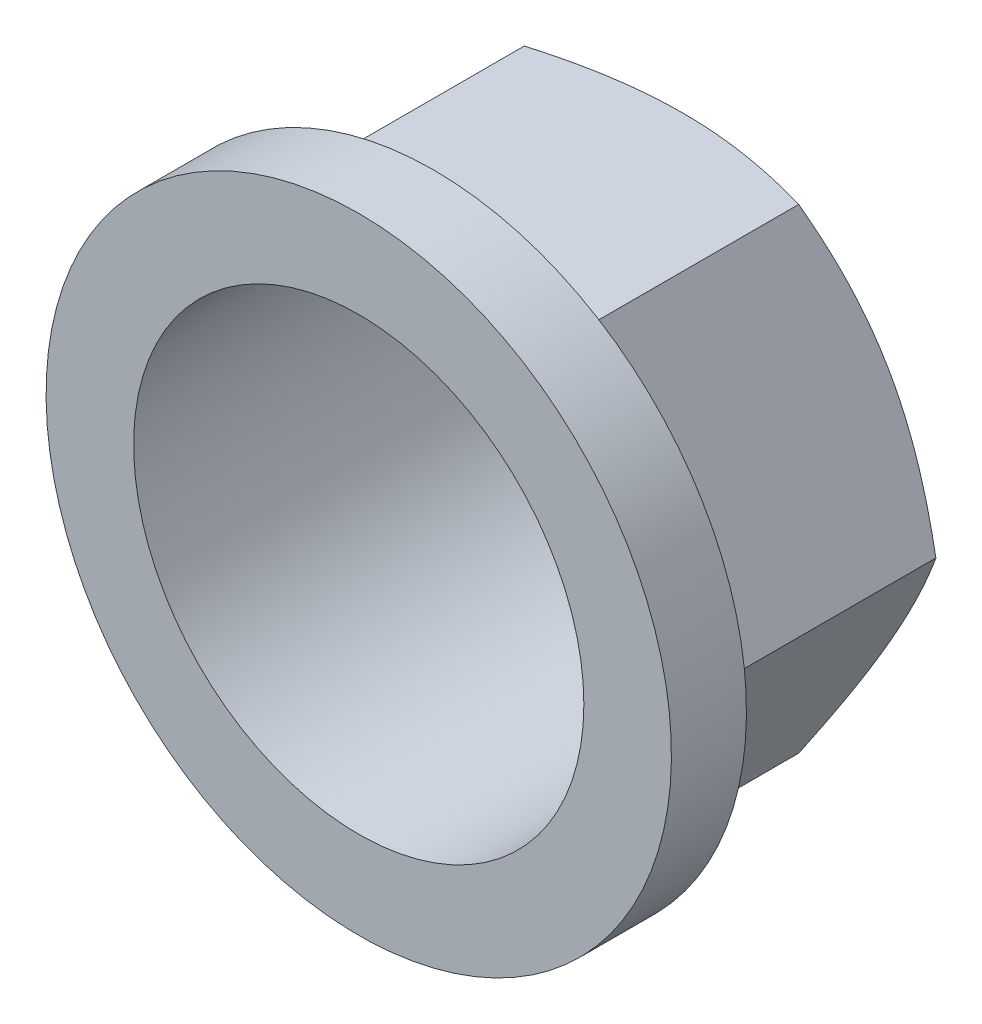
from build123d import *

# Parameters (mm, degrees)
BASE_EXTRUSION_DEPTH    = 5.4
ESQUISSE4_R             = 7.2
ENL_V_MAT_EXTRU_1_DEPTH = 19.089315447
ESQUISSE6_W             = 3
ESQUISSE6_H             = 12.5
ESQUISSE7_R             = 7.2
ENL_V_MAT_EXTRU_2_DEPTH = 21.28625735
ESQUISSE8_R             = 9
ENL_V_MAT_EXTRU_3_DEPTH = 22.914406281


with BuildPart() as part:
    # Esquisse1 → Base-Extrusion (new, symmetric)
    with BuildSketch(Plane.XY):
        Polygon((5.484827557, -9.5), (10.969655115, 0), (5.484827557, 9.5), (-5.484827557, 9.5), (-10.969655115, 0), (-5.484827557, -9.5), align=None)
    extrude(amount=BASE_EXTRUSION_DEPTH, both=True)

    # Esquisse4 → Enl_v. mat.-Extru.1 (cut, through all)
    with BuildSketch(Plane.XY.offset(5.4)):
        Circle(ESQUISSE4_R)
    extrude(amount=-ENL_V_MAT_EXTRU_1_DEPTH, mode=Mode.SUBTRACT)

    # Esquisse5 → Enl_vement de mati_re-R_volution1 (revolve, cut)
    with BuildSketch(Plane(origin=(0, 0, 0), x_dir=(0, 0, -1), z_dir=(1, 0, 0))):
        Polygon((5.4, -9.5), (-5.4, -28.206148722), (5.4, -28.206148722), align=None)
    enl_vement_de_mati_re_r_volution1 = revolve(axis=Axis((0, 0, 0), (0, 0, 1)), mode=Mode.SUBTRACT)

    # Sym_trie1: Enl_vement de mati_re-R_volution1 across plane
    add(enl_vement_de_mati_re_r_volution1.mirror(Plane.XY), mode=Mode.SUBTRACT)

    # Esquisse6 → R_volution1 (revolve)
    with BuildSketch(Plane(origin=(0, 0, 0), x_dir=(0, 0, -1), z_dir=(1, 0, 0))):
        with Locations((-6.051494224, 6.25)):
            Rectangle(ESQUISSE6_W, ESQUISSE6_H)
    revolve(axis=Axis((0, 0, 0), (0, 0, 1)))

    # Esquisse7 → Enl_v. mat.-Extru.2 (cut, through all)
    with BuildSketch(Plane(origin=(0, 0, 4.551494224), x_dir=(-1, 0, 0), z_dir=(0, 0, -1))):
        with Locations(Location((0, 0, 0), (0, 0, 180))):
            Circle(ESQUISSE7_R)
    extrude(amount=-ENL_V_MAT_EXTRU_2_DEPTH, mode=Mode.SUBTRACT)

    # Esquisse8 → Enl_v. mat.-Extru.3 (cut, through all)
    with BuildSketch(Plane.XY.offset(7.551494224)):
        Circle(ESQUISSE8_R)
    extrude(amount=-ENL_V_MAT_EXTRU_3_DEPTH, mode=Mode.SUBTRACT)


solid = part.part
